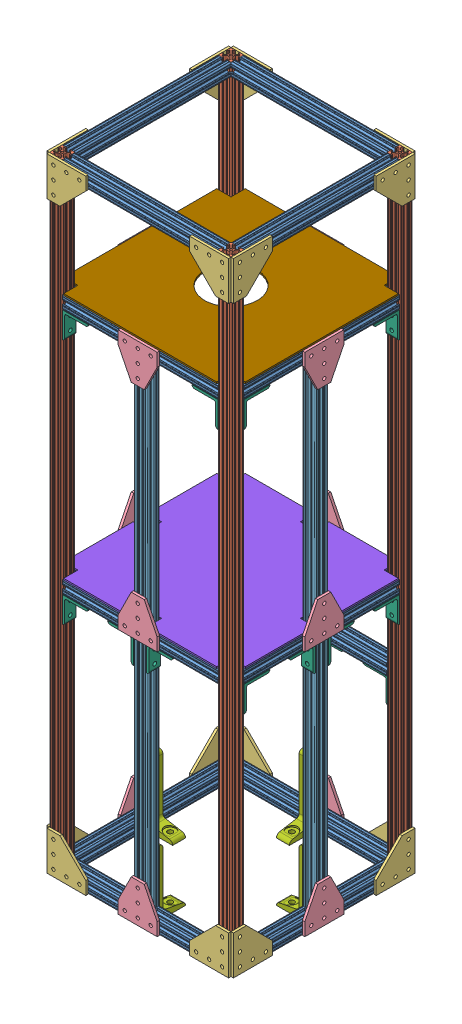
SolidWorks assembly Propellant_Tank_Support.SLDASM, configuration Default (file format 15000). Lengths in mm.
Overall size (367.63 1219.2 365.12).
88 component instances, 9 part files, 259 mates.
Components (placement in the parent):
- 1 foot t slot-1: 1 foot t slot.SLDPRT [47065T411] at (115.7798 156.8335 234.415) size (25.4 25.4 304.8)
- 4 feet t-slot-1: 4 feet t-slot.SLDPRT [47065T413] at (115.7798 906.1335 399.515) x (0 0 1) z (0 -1 0) size (25.4 25.4 1219.2)
- 4 feet t-slot-2: 4 feet t-slot.SLDPRT [47065T413] at (115.7798 601.3335 69.315) x (1 0 0) z (0 1 0) size (25.4 25.4 1219.2)
- 1 foot t slot-2: 1 foot t slot.SLDPRT [47065T411] at (280.8798 156.8335 399.515) x (0 0 1) z (-1 0 0) size (25.4 25.4 304.8)
- 1 foot t slot-3: 1 foot t slot.SLDPRT [47065T411] at (280.8798 321.9335 69.315) x (1 0 0) z (0 -1 0) size (25.4 25.4 304.8)
- 1 foot t slot-4: 1 foot t slot.SLDPRT [47065T411] at (445.9798 156.8335 234.415) size (25.4 25.4 304.8)
- 1 foot t slot-5: 1 foot t slot.SLDPRT [47065T411] at (280.8798 156.8335 69.315) x (0 0 -1) z (1 0 0) size (25.4 25.4 304.8)
- 4 feet t-slot-3: 4 feet t-slot.SLDPRT [47065T413] at (445.9798 906.1335 399.515) x (0 0 1) z (0 -1 0) size (25.4 25.4 1219.2)
- 4 feet t-slot-4: 4 feet t-slot.SLDPRT [47065T413] at (445.9798 601.3335 69.315) x (1 0 0) z (0 1 0) size (25.4 25.4 1219.2)
- 1 foot t slot-6: 1 foot t slot.SLDPRT [47065T411] at (115.7798 1350.6335 234.415) size (25.4 25.4 304.8)
- 1 foot t slot-7: 1 foot t slot.SLDPRT [47065T411] at (280.8798 1350.6335 399.515) x (0 1 0) z (1 0 0) size (25.4 25.4 304.8)
- 1 foot t slot-8: 1 foot t slot.SLDPRT [47065T411] at (280.8798 1350.6335 69.315) x (0 0 1) z (-1 0 0) size (25.4 25.4 304.8)
- corner brace-1: corner brace.SLDPRT [47065T267] at (103.0798 144.1335 54.2337) size (76.2 76.2 4.76)
- corner brace-2: corner brace.SLDPRT [47065T267] at (461.061 144.1335 412.215) x (0 0 -1) z (1 0 0) size (76.2 76.2 4.76)
- corner brace-3: corner brace.SLDPRT [47065T267] at (450.4883 144.1335 54.2337) x (-1 0 0) z (0 0 -1) size (76.2 76.2 4.76)
- corner brace-4: corner brace.SLDPRT [47065T267] at (458.6798 144.1335 414.5962) x (-1 0 0) z (0 0 -1) size (76.2 76.2 4.76)
- corner brace-5: corner brace.SLDPRT [47065T267] at (461.061 144.1335 56.615) x (0 0 1) z (-1 0 0) size (76.2 76.2 4.76)
- corner brace-6: corner brace.SLDPRT [47065T267] at (100.6985 144.1335 56.615) x (0 0 1) z (-1 0 0) size (76.2 76.2 4.76)
- corner brace-7: corner brace.SLDPRT [47065T267] at (100.6985 144.1335 412.215) x (0 0 -1) z (1 0 0) size (76.2 76.2 4.76)
- corner brace-8: corner brace.SLDPRT [47065T267] at (103.0798 144.1335 414.5962) size (76.2 76.2 4.76)
- corner brace-9: corner brace.SLDPRT [47065T267] at (458.6798 1363.3335 414.5962) x (-1 0 0) z (0 0 1) size (76.2 76.2 4.76)
- corner brace-10: corner brace.SLDPRT [47065T267] at (461.061 1363.3335 412.215) x (0 0 -1) z (-1 0 0) size (76.2 76.2 4.76)
- corner brace-11: corner brace.SLDPRT [47065T267] at (100.6985 1363.3335 412.215) x (0 -1 0) z (1 0 0) size (76.2 76.2 4.76)
- corner brace-12: corner brace.SLDPRT [47065T267] at (103.0798 1363.3335 414.5962) x (0 -1 0) z (0 0 1) size (76.2 76.2 4.76)
- corner brace-13: corner brace.SLDPRT [47065T267] at (103.0798 1363.3335 54.2337) x (1 0 0) z (0 0 -1) size (76.2 76.2 4.76)
- corner brace-14: corner brace.SLDPRT [47065T267] at (100.6985 1363.3335 56.615) x (0 0 1) z (1 0 0) size (76.2 76.2 4.76)
- corner brace-15: corner brace.SLDPRT [47065T267] at (461.061 1363.3335 56.615) x (0 -1 0) z (-1 0 0) size (76.2 76.2 4.76)
- corner brace-16: corner brace.SLDPRT [47065T267] at (458.6798 1363.3335 54.2337) x (0 -1 0) z (0 0 -1) size (76.2 76.2 4.76)
- t bracket-1: t bracket.SLDPRT [47065T278] at (100.6985 144.1335 196.315) x (0 0 1) z (-1 0 0) size (76.2 76.2 4.76)
- t bracket-2: t bracket.SLDPRT [47065T278] at (318.9798 1134.7335 54.2337) x (-1 0 0) z (0 0 1) size (76.2 76.2 4.76)
- t bracket-3: t bracket.SLDPRT [47065T278] at (242.7798 144.1335 414.5962) size (76.2 76.2 4.76)
- t bracket-4: t bracket.SLDPRT [47065T278] at (461.061 144.1335 272.515) x (0 0 -1) z (1 0 0) size (76.2 76.2 4.76)
- t bracket-5: t bracket.SLDPRT [47065T278] at (242.7798 144.1335 54.2337) size (76.2 76.2 4.76)
- 1.5 feet t-slot-1: 1.5 feet t-slot.SLDPRT [47065T209] at (445.9798 474.3335 234.415) x (0 0 -1) z (0 -1 0) size (25.4 25.4 457.2)
- 1.5 feet t-slot-2: 1.5 feet t-slot.SLDPRT [47065T209] at (115.7798 474.3335 234.415) x (0 0 1) z (0 -1 0) size (25.4 25.4 457.2)
- 1.5 feet t-slot-3: 1.5 feet t-slot.SLDPRT [47065T209] at (280.8798 321.9335 399.515) x (1 0 0) z (0 1 0) size (25.4 25.4 457.2)
- 1 foot t slot-10: 1 foot t slot.SLDPRT [47065T411] at (115.7798 639.4335 234.415) size (25.4 25.4 304.8)
- 1 foot t slot-11: 1 foot t slot.SLDPRT [47065T411] at (280.8798 639.4335 399.515) x (0 0 1) z (-1 0 0) size (25.4 25.4 304.8)
- 1 foot t slot-12: 1 foot t slot.SLDPRT [47065T411] at (445.9798 639.4335 234.415) size (25.4 25.4 304.8)
- 1 foot t slot-13: 1 foot t slot.SLDPRT [47065T411] at (280.8798 487.0335 69.315) x (0 0 -1) z (1 0 0) size (25.4 25.4 304.8)
- corner brace_2-1: corner brace_2.SLDPRT [47065T239] at (114.1923 626.7335 82.015) x (0 -1 0) z (-1 0 0) size (50.8 50.8 22.23)
- corner brace_2-2: corner brace_2.SLDPRT [47065T239] at (114.1923 626.7335 386.815) x (0 -1 0) z (1 0 0) size (50.8 50.8 22.23)
- corner brace_2-3: corner brace_2.SLDPRT [47065T239] at (447.5673 626.7335 82.015) x (0 -1 0) z (-1 0 0) size (50.8 50.8 22.23)
- corner brace_2-4: corner brace_2.SLDPRT [47065T239] at (433.2798 474.3335 67.7275) x (0 -1 0) z (0 0 -1) size (50.8 50.8 22.23)
- corner brace_2-5: corner brace_2.SLDPRT [47065T239] at (447.5673 626.7335 386.815) x (0 -1 0) z (1 0 0) size (50.8 50.8 22.23)
- corner brace_2-6: corner brace_2.SLDPRT [47065T239] at (128.4798 626.7335 401.1025) x (0 -1 0) z (0 0 1) size (50.8 50.8 22.23)
- corner brace_2-7: corner brace_2.SLDPRT [47065T239] at (128.4798 474.3335 67.7275) x (0 -1 0) z (0 0 1) size (50.8 50.8 22.23)
- 1 foot t slot-14: 1 foot t slot.SLDPRT [47065T411] at (445.9798 1350.6335 234.415) x (-1 0 0) z (0 0 -1) size (25.4 25.4 304.8)
- 1 foot t slot-15: 1 foot t slot.SLDPRT [47065T411] at (280.8798 639.4335 69.315) x (0 0 1) z (-1 0 0) size (25.4 25.4 304.8)
- corner brace_2-8: corner brace_2.SLDPRT [47065T239] at (433.2798 626.7335 67.7275) x (0 -1 0) z (0 0 -1) size (50.8 50.8 22.23)
- corner brace_2-9: corner brace_2.SLDPRT [47065T239] at (128.4798 626.7335 67.7275) x (0 -1 0) z (0 0 1) size (50.8 50.8 22.23)
- 1.5 feet t-slot-4: 1.5 feet t-slot.SLDPRT [47065T209] at (280.8798 804.5335 399.515) x (1 0 0) z (0 1 0) size (25.4 25.4 457.2)
- 1.5 feet t-slot-5: 1.5 feet t-slot.SLDPRT [47065T209] at (115.7798 804.5335 234.415) x (1 0 0) z (0 1 0) size (25.4 25.4 457.2)
- 1.5 feet t-slot-6: 1.5 feet t-slot.SLDPRT [47065T209] at (445.9798 804.5335 234.415) x (1 0 0) z (0 1 0) size (25.4 25.4 457.2)
- 1.5 feet t-slot-7: 1.5 feet t-slot.SLDPRT [47065T209] at (280.8798 804.5335 69.315) x (1 0 0) z (0 1 0) size (25.4 25.4 457.2)
- 1 foot t slot-16: 1 foot t slot.SLDPRT [47065T411] at (445.9798 1122.0335 234.415) size (25.4 25.4 304.8)
- 1 foot t slot-17: 1 foot t slot.SLDPRT [47065T411] at (115.7798 1122.0335 234.415) size (25.4 25.4 304.8)
- 1 foot t slot-18: 1 foot t slot.SLDPRT [47065T411] at (280.8798 1122.0335 69.315) x (0 0 -1) z (1 0 0) size (25.4 25.4 304.8)
- 1 foot t slot-19: 1 foot t slot.SLDPRT [47065T411] at (280.8798 1122.0335 399.515) x (0 0 -1) z (1 0 0) size (25.4 25.4 304.8)
- t bracket-10: t bracket.SLDPRT [47065T278] at (461.061 1134.7335 196.315) x (0 0 1) z (1 0 0) size (76.2 76.2 4.76)
- t bracket-11: t bracket.SLDPRT [47065T278] at (242.7798 1134.7335 414.5962) x (1 0 0) z (0 0 -1) size (76.2 76.2 4.76)
- t bracket-12: t bracket.SLDPRT [47065T278] at (100.6985 1134.7335 272.515) x (0 0 -1) z (-1 0 0) size (76.2 76.2 4.76)
- corner brace_2-11: corner brace_2.SLDPRT [47065T239] at (128.4798 1109.3335 401.1025) x (0 -1 0) z (0 0 1) size (50.8 50.8 22.23)
- corner brace_2-12: corner brace_2.SLDPRT [47065T239] at (433.2798 1109.3335 401.1025) x (0 -1 0) z (0 0 -1) size (50.8 50.8 22.23)
- corner brace_2-13: corner brace_2.SLDPRT [47065T239] at (447.5673 1109.3335 82.015) x (0 -1 0) z (-1 0 0) size (50.8 50.8 22.23)
- corner brace_2-14: corner brace_2.SLDPRT [47065T239] at (447.5673 1109.3335 386.815) x (0 -1 0) z (1 0 0) size (50.8 50.8 22.23)
- corner brace_2-15: corner brace_2.SLDPRT [47065T239] at (128.4798 1109.3335 67.7275) x (0 -1 0) z (0 0 1) size (50.8 50.8 22.23)
- corner brace_2-16: corner brace_2.SLDPRT [47065T239] at (433.2798 1109.3335 67.7275) x (-1 0 0) z (0 0 1) size (50.8 50.8 22.23)
- corner brace_2-17: corner brace_2.SLDPRT [47065T239] at (114.1923 1109.3335 386.815) x (0 -1 0) z (1 0 0) size (50.8 50.8 22.23)
- corner brace_2-18: corner brace_2.SLDPRT [47065T239] at (106.9211 1109.3335 82.015) x (0 -1 0) z (-1 0 0) size (50.8 50.8 22.23)
- 47065T841_ALUMINUM T-SLOTTED FRAMING EXTRUSION-1: 47065T841_ALUMINUM T-SLOTTED FRAMING EXTRUSION.SLDPRT [47065T841] at (433.2798 144.1335 234.415) x (-1 0 0) z (0 0 -1) size (50.8 127 25.4)
- 47065T841_ALUMINUM T-SLOTTED FRAMING EXTRUSION-2: 47065T841_ALUMINUM T-SLOTTED FRAMING EXTRUSION.SLDPRT [47065T841] at (280.8798 144.1335 386.815) x (0 0 -1) z (1 0 0) size (50.8 127 25.4)
- 47065T841_ALUMINUM T-SLOTTED FRAMING EXTRUSION-3: 47065T841_ALUMINUM T-SLOTTED FRAMING EXTRUSION.SLDPRT [47065T841] at (280.8798 144.1335 82.015) x (0 0 1) z (-1 0 0) size (50.8 127 25.4)
- 47065T841_ALUMINUM T-SLOTTED FRAMING EXTRUSION-4: 47065T841_ALUMINUM T-SLOTTED FRAMING EXTRUSION.SLDPRT [47065T841] at (128.4798 144.1335 234.415) size (50.8 127 25.4)
- Tank Support Bottom Plate-1: Tank Support Bottom Plate.SLDPRT [Default] at (280.8798 652.1335 234.415) size (355.6 3.17 355.6)
- Tank Support Top Plate-1: Tank Support Top Plate.SLDPRT [Default] at (280.8798 1134.7335 234.415) size (355.6 3.17 355.6)
- corner brace_2-19: corner brace_2.SLDPRT [47065T239] at (114.1923 626.7335 221.715) x (0 -1 0) z (1 0 0) size (50.8 50.8 22.23)
- corner brace_2-20: corner brace_2.SLDPRT [47065T239] at (447.5673 626.7335 221.715) x (0 -1 0) z (1 0 0) size (50.8 50.8 22.23)
- corner brace_2-21: corner brace_2.SLDPRT [47065T239] at (447.5673 626.7335 247.115) x (0 -1 0) z (-1 0 0) size (50.8 50.8 22.23)
- corner brace_2-22: corner brace_2.SLDPRT [47065T239] at (268.1798 626.7335 401.1025) x (0 -1 0) z (0 0 -1) size (50.8 50.8 22.23)
- corner brace_2-23: corner brace_2.SLDPRT [47065T239] at (293.5798 626.7335 401.1025) x (0 -1 0) z (0 0 1) size (50.8 50.8 22.23)
- corner brace_2-24: corner brace_2.SLDPRT [47065T239] at (114.1923 626.7335 247.115) x (0 -1 0) z (-1 0 0) size (50.8 50.8 22.23)
- corner brace_2-25: corner brace_2.SLDPRT [47065T239] at (293.5798 474.3335 67.7275) x (0 -1 0) z (0 0 1) size (50.8 50.8 22.23)
- corner brace_2-26: corner brace_2.SLDPRT [47065T239] at (268.1798 474.3335 67.7275) x (0 -1 0) z (0 0 -1) size (50.8 50.8 22.23)
- t bracket-13: t bracket.SLDPRT [47065T278] at (461.061 626.7335 196.315) x (0 0 1) z (-1 0 0) size (76.2 76.2 4.76)
- t bracket-14: t bracket.SLDPRT [47065T278] at (318.9798 626.7335 54.2337) x (-1 0 0) z (0 0 -1) size (76.2 76.2 4.76)
- t bracket-15: t bracket.SLDPRT [47065T278] at (242.7798 626.7335 414.5962) size (76.2 76.2 4.76)
- t bracket-16: t bracket.SLDPRT [47065T278] at (100.6985 626.7335 272.515) x (0 0 -1) z (1 0 0) size (76.2 76.2 4.76)
Mates (geometry in assembly coordinates):
- Coincident2: coincident aligned: plane of 1 foot t slot-1 through (122.1129 144.1335 386.815) normal (0 -1 0); plane of 4 feet t-slot-1 through (125.1896 144.1335 393.0986) normal (0 -1 0)
- Coincident3: coincident anti-aligned: plane of 1 foot t slot-1 through (109.3634 147.4237 386.815) normal (0 0 1); plane of 4 feet t-slot-1 through (122.1129 144.1335 386.815) normal (0 0 -1)
- Coincident4: coincident aligned: plane of 1 foot t slot-1 through (103.0798 150.5005 386.815) normal (-1 0 0); plane of 4 feet t-slot-1 through (103.0798 144.1335 393.1819) normal (-1 0 0)
- Coincident5: coincident aligned: plane of 1 foot t slot-1 through (106.2293 144.1335 386.815) normal (0 -1 0); plane of 4 feet t-slot-2 through (103.0798 144.1335 28.8532) normal (0 -1 0)
- Coincident6: coincident anti-aligned: plane of 1 foot t slot-1 through (109.3634 147.4237 82.015) normal (0 0 -1); plane of 4 feet t-slot-2 through (122.1129 1363.3335 82.015) normal (0 0 1)
- Coincident7: coincident aligned: plane of 1 foot t slot-1 through (128.4798 163.1666 386.815) normal (1 0 0); plane of 4 feet t-slot-2 through (128.4798 1363.3335 62.9819) normal (1 0 0)
- Coincident8: coincident aligned: plane of 4 feet t-slot-1 through (125.3302 144.1335 412.215) normal (0 0 1); plane of 1 foot t slot-2 through (128.4798 163.1666 412.215) normal (0 0 1)
- Coincident9: coincident aligned: plane of 4 feet t-slot-1 through (125.1896 144.1335 393.0986) normal (0 -1 0); plane of 1 foot t slot-2 through (128.4798 144.1335 405.8481) normal (0 -1 0)
- Coincident10: coincident anti-aligned: plane of 4 feet t-slot-1 through (128.4798 144.1335 405.8481) normal (1 0 0); plane of 1 foot t slot-2 through (128.4798 147.4237 393.0986) normal (-1 0 0)
- Coincident11: coincident anti-aligned: plane of 1 foot t slot-2 through (433.2798 147.4237 393.0986) normal (1 0 0); plane of 4 feet t-slot-3 through (433.2798 144.1335 409.0654) normal (-1 0 0)
- Coincident12: coincident aligned: plane of 1 foot t slot-2 through (128.4798 163.1666 412.215) normal (0 0 1); plane of 4 feet t-slot-3 through (455.5302 144.1335 412.215) normal (0 0 1)
- Coincident13: coincident aligned: plane of 1 foot t slot-2 through (128.4798 144.1335 389.9645) normal (0 -1 0); plane of 4 feet t-slot-3 through (455.3896 144.1335 393.0986) normal (0 -1 0)
- Coincident14: coincident anti-aligned: plane of 1 foot t slot-4 through (439.5634 147.4237 386.815) normal (0 0 1); plane of 4 feet t-slot-3 through (452.3129 144.1335 386.815) normal (0 0 -1)
- Coincident15: coincident aligned: plane of 1 foot t slot-4 through (458.6798 147.2831 386.815) normal (1 0 0); plane of 4 feet t-slot-3 through (458.6798 144.1335 389.9645) normal (1 0 0)
- Coincident16: coincident aligned: plane of 1 foot t slot-4 through (452.3129 144.1335 386.815) normal (0 -1 0); plane of 4 feet t-slot-3 through (455.3896 144.1335 393.0986) normal (0 -1 0)
- Coincident17: coincident aligned: plane of 4 feet t-slot-2 through (125.3302 1363.3335 56.615) normal (0 0 -1); plane of 1 foot t slot-5 through (433.2798 163.1666 56.615) normal (0 0 -1)
- Coincident18: coincident anti-aligned: plane of 4 feet t-slot-2 through (128.4798 1363.3335 62.9819) normal (1 0 0); plane of 1 foot t slot-5 through (128.4798 147.4237 75.7314) normal (-1 0 0)
- Coincident19: coincident aligned: plane of 4 feet t-slot-2 through (103.0798 144.1335 28.8532) normal (0 -1 0); plane of 1 foot t slot-5 through (433.2798 144.1335 62.9819) normal (0 -1 0)
- Coincident20: coincident aligned: plane of 1 foot t slot-5 through (433.2798 147.2831 56.615) normal (0 0 -1); plane of 4 feet t-slot-4 through (455.5302 1363.3335 56.615) normal (0 0 -1)
- Coincident21: coincident aligned: plane of 1 foot t slot-4 through (458.6798 147.2831 386.815) normal (1 0 0); plane of 4 feet t-slot-4 through (458.6798 1363.3335 62.9819) normal (1 0 0)
- Coincident22: coincident aligned: plane of 1 foot t slot-5 through (433.2798 144.1335 62.9819) normal (0 -1 0); plane of 4 feet t-slot-4 through (433.2798 144.1335 28.8532) normal (0 -1 0)
- Coincident26: coincident aligned: plane of 4 feet t-slot-4 through (439.6467 1363.3335 56.615) normal (0 0 -1); plane of 1 foot t slot-8 through (128.4798 1360.1839 56.615) normal (0 0 -1)
- Coincident27: coincident anti-aligned: plane of 4 feet t-slot-4 through (433.2798 1363.3335 75.6481) normal (-1 0 0); plane of 1 foot t slot-8 through (433.2798 1341.2237 62.8986) normal (1 0 0)
- Coincident28: coincident aligned: plane of 4 feet t-slot-4 through (439.5634 1363.3335 78.7248) normal (0 1 0); plane of 1 foot t slot-8 through (128.4798 1363.3335 78.8654) normal (0 1 0)
- Coincident29: coincident anti-aligned: plane of 4 feet t-slot-2 through (106.2293 1363.3335 82.015) normal (0 0 1); plane of 1 foot t slot-6 through (109.3634 1341.2237 82.015) normal (0 0 -1)
- Coincident30: coincident aligned: plane of 4 feet t-slot-2 through (103.0798 1363.3335 75.6481) normal (-1 0 0); plane of 1 foot t slot-6 through (103.0798 1360.1839 386.815) normal (-1 0 0)
- Coincident31: coincident aligned: plane of 4 feet t-slot-2 through (109.3634 1363.3335 78.7248) normal (0 1 0); plane of 1 foot t slot-6 through (109.4467 1363.3335 386.815) normal (0 1 0)
- Coincident32: coincident aligned: plane of 4 feet t-slot-1 through (125.3302 144.1335 412.215) normal (0 0 1); plane of 1 foot t slot-7 through (433.2798 1360.184 412.215) normal (0 0 1)
- Coincident33: coincident aligned: plane of 4 feet t-slot-1 through (75.318 1363.3335 386.815) normal (0 1 0); plane of 1 foot t slot-7 through (433.2798 1363.3335 405.8481) normal (0 1 0)
- Coincident34: coincident anti-aligned: plane of 4 feet t-slot-1 through (128.4798 144.1335 405.8481) normal (1 0 0); plane of 1 foot t slot-7 through (128.4798 1344.2171 390.1052) normal (-1 0 0)
- Coincident35: coincident aligned: plane of 4 feet t-slot-2 through (103.0798 1363.3335 59.7646) normal (-1 0 0); plane of corner brace-1 through (103.0798 144.1335 56.615) normal (-1 0 0)
- Coincident36: coincident aligned: plane of 4 feet t-slot-2 through (103.0798 144.1335 28.8532) normal (0 -1 0); plane of corner brace-1 through (179.2798 144.1335 56.615) normal (0 -1 0)
- Coincident37: coincident anti-aligned: plane of 4 feet t-slot-2 through (109.4467 1363.3335 56.615) normal (0 0 -1); plane of corner brace-1 through (103.0798 144.1335 56.615) normal (0 0 1)
- Coincident38: coincident anti-aligned: plane of 1 foot t slot-5 through (433.2798 147.2831 56.615) normal (0 0 -1); plane of corner brace-3 through (450.4883 144.1335 56.615) normal (0 0 1)
- Coincident39: coincident aligned: plane of 4 feet t-slot-4 through (450.4883 1363.3335 70.9082) normal (1 0 0); plane of corner brace-3 through (450.4883 144.1335 51.8525) normal (1 0 0)
- Coincident40: coincident aligned: plane of 1 foot t slot-5 through (433.2798 144.1335 62.9819) normal (0 -1 0); plane of corner brace-3 through (374.2883 144.1335 51.8525) normal (0 -1 0)
- Coincident41: coincident anti-aligned: plane of 1 foot t slot-4 through (458.6798 147.2831 386.815) normal (1 0 0); plane of corner brace-5 through (458.6798 144.1335 56.615) normal (-1 0 0)
- Coincident42: coincident aligned: plane of 4 feet t-slot-4 through (455.5302 1363.3335 56.615) normal (0 0 -1); plane of corner brace-5 through (458.6798 144.1335 56.615) normal (0 0 -1)
- Coincident43: coincident aligned: plane of 4 feet t-slot-4 through (433.2798 144.1335 28.8532) normal (0 -1 0); plane of corner brace-5 through (458.6798 144.1335 132.815) normal (0 -1 0)
- Coincident44: coincident aligned: plane of 4 feet t-slot-2 through (109.4467 1363.3335 56.615) normal (0 0 -1); plane of corner brace-6 through (98.3173 144.1335 56.615) normal (0 0 -1)
- Coincident45: coincident aligned: plane of 4 feet t-slot-2 through (103.0798 144.1335 28.8532) normal (0 -1 0); plane of corner brace-6 through (98.3173 144.1335 132.815) normal (0 -1 0)
- Coincident46: coincident anti-aligned: plane of 4 feet t-slot-2 through (103.0798 1363.3335 75.6481) normal (-1 0 0); plane of corner brace-6 through (103.0798 144.1335 56.615) normal (1 0 0)
- Coincident47: coincident aligned: plane of 4 feet t-slot-1 through (109.4467 144.1335 412.215) normal (0 0 1); plane of corner brace-7 through (103.0798 144.1335 412.215) normal (0 0 1)
- Coincident48: coincident aligned: plane of 1 foot t slot-1 through (106.2293 144.1335 386.815) normal (0 -1 0); plane of corner brace-7 through (103.0798 144.1335 336.015) normal (0 -1 0)
- Coincident49: coincident anti-aligned: plane of 1 foot t slot-1 through (103.0798 150.5005 386.815) normal (-1 0 0); plane of corner brace-7 through (103.0798 144.1335 412.215) normal (1 0 0)
- Coincident50: coincident anti-aligned: plane of 4 feet t-slot-3 through (458.6798 144.1335 405.8481) normal (1 0 0); plane of corner brace-2 through (458.6798 144.1335 412.215) normal (-1 0 0)
- Coincident51: coincident aligned: plane of 4 feet t-slot-3 through (455.5302 144.1335 412.215) normal (0 0 1); plane of corner brace-2 through (463.4423 144.1335 412.215) normal (0 0 1)
- Coincident52: coincident aligned: plane of 4 feet t-slot-3 through (455.3896 144.1335 393.0986) normal (0 -1 0); plane of corner brace-2 through (463.4423 144.1335 336.015) normal (0 -1 0)
- Coincident53: coincident anti-aligned: plane of 4 feet t-slot-3 through (439.6467 144.1335 412.215) normal (0 0 1); plane of corner brace-4 through (458.6798 144.1335 412.215) normal (0 0 -1)
- Coincident54: coincident aligned: plane of 4 feet t-slot-3 through (458.6798 144.1335 405.8481) normal (1 0 0); plane of corner brace-4 through (458.6798 144.1335 412.215) normal (1 0 0)
- Coincident55: coincident aligned: plane of 4 feet t-slot-3 through (455.3896 144.1335 393.0986) normal (0 -1 0); plane of corner brace-4 through (382.4798 144.1335 412.215) normal (0 -1 0)
- Coincident56: coincident aligned: plane of 4 feet t-slot-1 through (103.0798 144.1335 409.0654) normal (-1 0 0); plane of corner brace-8 through (103.0798 144.1335 416.9775) normal (-1 0 0)
- Coincident57: coincident aligned: plane of 4 feet t-slot-1 through (125.1896 144.1335 393.0986) normal (0 -1 0); plane of corner brace-8 through (179.2798 144.1335 416.9775) normal (0 -1 0)
- Coincident58: coincident anti-aligned: plane of 4 feet t-slot-1 through (125.3302 144.1335 412.215) normal (0 0 1); plane of corner brace-8 through (103.0798 144.1335 412.215) normal (0 0 -1)
- Coincident59: coincident aligned: plane of 1 foot t slot-7 through (433.2798 1363.3335 405.8481) normal (0 1 0); plane of corner brace-12 through (103.0798 1363.3335 416.9775) normal (0 1 0)
- Coincident60: coincident aligned: plane of 4 feet t-slot-1 through (103.0798 144.1335 409.0654) normal (-1 0 0); plane of corner brace-12 through (103.0798 1287.1335 416.9775) normal (-1 0 0)
- Coincident61: coincident anti-aligned: plane of 4 feet t-slot-1 through (125.3302 144.1335 412.215) normal (0 0 1); plane of corner brace-12 through (103.0798 1363.3335 412.215) normal (0 0 -1)
- Coincident62: coincident anti-aligned: plane of 4 feet t-slot-1 through (103.0798 144.1335 409.0654) normal (-1 0 0); plane of corner brace-11 through (103.0798 1363.3335 412.215) normal (1 0 0)
- Coincident63: coincident aligned: plane of 1 foot t slot-6 through (109.4467 1363.3335 386.815) normal (0 1 0); plane of corner brace-11 through (103.0798 1363.3335 412.215) normal (0 1 0)
- Coincident64: coincident: plane of corner brace-11 through (103.0798 1287.1335 412.215) normal (0 0 1); line of corner brace-12 through (103.0798 1363.3335 412.215) axis (0 -1 0)
- Coincident65: coincident aligned: plane of 1 foot t slot-7 through (433.2798 1363.3335 405.8481) normal (0 1 0); plane of corner brace-9 through (382.4798 1363.3335 416.9775) normal (0 1 0)
- Coincident66: coincident aligned: plane of 4 feet t-slot-3 through (458.6798 144.1335 405.8481) normal (1 0 0); plane of corner brace-9 through (458.6798 1363.3335 416.9775) normal (1 0 0)
- Coincident67: coincident anti-aligned: plane of 4 feet t-slot-3 through (455.5302 144.1335 412.215) normal (0 0 1); plane of corner brace-9 through (458.6798 1363.3335 412.215) normal (0 0 -1)
- Coincident69: coincident: line of corner brace-9 through (458.6798 1287.1335 412.215) axis (0 1 0); plane of corner brace-10 through (458.6798 1363.3335 412.215) normal (0 0 1)
- Coincident70: coincident anti-aligned: plane of 4 feet t-slot-3 through (458.6798 144.1335 405.8481) normal (1 0 0); plane of corner brace-10 through (458.6798 1363.3335 412.215) normal (-1 0 0)
- Coincident72: coincident aligned: plane of 4 feet t-slot-4 through (455.5302 1363.3335 56.615) normal (0 0 -1); plane of corner brace-15 through (458.6798 1287.1335 56.615) normal (0 0 -1)
- Coincident73: coincident aligned: plane of 4 feet t-slot-4 through (439.5634 1363.3335 78.7248) normal (0 1 0); plane of corner brace-15 through (458.6798 1363.3335 56.615) normal (0 1 0)
- Coincident74: coincident: line of corner brace-15 through (458.6798 1363.3335 56.615) axis (0 -1 0); plane of corner brace-16 through (458.6798 1287.1335 51.8525) normal (1 0 0)
- Coincident75: coincident aligned: plane of 4 feet t-slot-4 through (439.5634 1363.3335 78.7248) normal (0 1 0); plane of corner brace-16 through (458.6798 1363.3335 51.8525) normal (0 1 0)
- Coincident76: coincident anti-aligned: plane of 4 feet t-slot-4 through (455.5302 1363.3335 56.615) normal (0 0 -1); plane of corner brace-16 through (458.6798 1363.3335 56.615) normal (0 0 1)
- Coincident77: coincident aligned: plane of 4 feet t-slot-2 through (103.0798 1363.3335 59.7646) normal (-1 0 0); plane of corner brace-13 through (103.0798 1363.3335 51.8525) normal (-1 0 0)
- Coincident78: coincident aligned: plane of 4 feet t-slot-2 through (109.3634 1363.3335 78.7248) normal (0 1 0); plane of corner brace-13 through (179.2798 1363.3335 51.8525) normal (0 1 0)
- Coincident79: coincident anti-aligned: plane of 4 feet t-slot-2 through (109.4467 1363.3335 56.615) normal (0 0 -1); plane of corner brace-13 through (103.0798 1363.3335 56.615) normal (0 0 1)
- Coincident80: coincident: line of corner brace-13 through (103.0798 1287.1335 56.615) axis (0 1 0); plane of corner brace-14 through (103.0798 1363.3335 56.615) normal (0 0 -1)
- Coincident81: coincident aligned: plane of 4 feet t-slot-2 through (109.3634 1363.3335 78.7248) normal (0 1 0); plane of corner brace-14 through (103.0798 1363.3335 132.815) normal (0 1 0)
- Coincident82: coincident anti-aligned: plane of 4 feet t-slot-2 through (103.0798 1363.3335 75.6481) normal (-1 0 0); plane of corner brace-14 through (103.0798 1363.3335 56.615) normal (1 0 0)
- Coincident83: coincident anti-aligned: plane of 1 foot t slot-1 through (103.0798 166.3839 386.815) normal (-1 0 0); plane of t bracket-1 through (103.0798 144.1335 196.315) normal (1 0 0)
- Coincident84: coincident aligned: plane of 1 foot t slot-1 through (106.2293 144.1335 386.815) normal (0 -1 0); plane of t bracket-1 through (98.3173 144.1335 272.515) normal (0 -1 0)
- Distance1: distance = 114.3 mm anti-aligned: plane of t bracket-1 through (98.3173 169.5335 272.515) normal (0 0 1); plane of 4 feet t-slot-1 through (122.1129 144.1335 386.815) normal (0 0 -1)
- Coincident86: coincident anti-aligned: plane of 1 foot t slot-2 through (128.4798 163.1666 412.215) normal (0 0 1); plane of t bracket-3 through (242.7798 144.1335 412.215) normal (0 0 -1)
- Coincident87: coincident aligned: plane of 1 foot t slot-2 through (128.4798 144.1335 405.8481) normal (0 -1 0); plane of t bracket-3 through (318.9798 144.1335 416.9775) normal (0 -1 0)
- Distance2: distance = 114.3 mm anti-aligned: plane of t bracket-3 through (242.7798 144.1335 416.9775) normal (-1 0 0); plane of 4 feet t-slot-1 through (128.4798 144.1335 405.8481) normal (1 0 0)
- Coincident89: coincident anti-aligned: plane of 1 foot t slot-4 through (458.6798 147.2831 386.815) normal (1 0 0); plane of t bracket-4 through (458.6798 144.1335 272.515) normal (-1 0 0)
- Coincident90: coincident aligned: plane of 1 foot t slot-4 through (452.3129 144.1335 386.815) normal (0 -1 0); plane of t bracket-4 through (463.4423 144.1335 196.315) normal (0 -1 0)
- Distance3: distance = 114.3 mm anti-aligned: plane of 4 feet t-slot-3 through (452.3129 144.1335 386.815) normal (0 0 -1); plane of t bracket-4 through (463.4423 144.1335 272.515) normal (0 0 1)
- Coincident92: coincident aligned: plane of 1 foot t slot-5 through (433.2798 144.1335 62.9819) normal (0 -1 0); plane of t bracket-5 through (318.9798 144.1335 56.615) normal (0 -1 0)
- Coincident93: coincident anti-aligned: plane of 1 foot t slot-5 through (433.2798 147.2831 56.615) normal (0 0 -1); plane of t bracket-5 through (242.7798 144.1335 56.615) normal (0 0 1)
- Distance4: distance = 114.3 mm anti-aligned: plane of t bracket-5 through (318.9798 169.5335 56.615) normal (1 0 0); plane of 4 feet t-slot-4 through (433.2798 1363.3335 59.7646) normal (-1 0 0)
- Coincident108: coincident anti-aligned: plane of 1 foot t slot-3 through (274.4634 169.5335 59.9052) normal (0 -1 0); plane of 1 foot t slot-5 through (433.2798 169.5335 59.7645) normal (0 1 0)
- Coincident109: coincident anti-aligned: plane of 1 foot t slot-3 through (271.3293 169.5335 56.615) normal (0 0 -1); plane of t bracket-5 through (242.7798 144.1335 56.615) normal (0 0 1)
- Coincident110: coincident: point of 1 foot t slot-3; moEndPointRef_w of t bracket-5
- Coincident120: coincident anti-aligned: plane of 1 foot t slot-2 through (128.4798 169.5335 409.0654) normal (0 1 0); plane of 1.5 feet t-slot-3 through (268.1798 169.5335 380.9154) normal (0 -1 0)
- Coincident121: coincident anti-aligned: plane of t bracket-3 through (242.7798 144.1335 412.215) normal (0 0 -1); plane of 1.5 feet t-slot-3 through (287.2129 626.7335 412.215) normal (0 0 1)
- Coincident122: coincident: line of t bracket-3 through (293.5798 220.3335 416.9775) axis (0 0 -1); plane of 1.5 feet t-slot-3 through (293.5798 626.7335 409.0654) normal (1 0 0)
- Coincident123: coincident anti-aligned: plane of 1 foot t slot-1 through (125.3302 169.5335 386.815) normal (0 1 0); plane of 1.5 feet t-slot-2 through (125.1896 169.5335 227.9986) normal (0 -1 0)
- Coincident124: coincident anti-aligned: plane of t bracket-1 through (103.0798 144.1335 196.315) normal (1 0 0); plane of 1.5 feet t-slot-2 through (103.0798 169.5335 243.9654) normal (-1 0 0)
- Coincident125: coincident: line of t bracket-1 through (98.3173 220.3335 247.115) axis (1 0 0); plane of 1.5 feet t-slot-2 through (109.4467 169.5335 247.115) normal (0 0 1)
- Coincident126: coincident anti-aligned: plane of 1 foot t slot-4 through (455.5302 169.5335 386.815) normal (0 1 0); plane of 1.5 feet t-slot-1 through (436.57 169.5335 240.8314) normal (0 -1 0)
- Coincident127: coincident anti-aligned: plane of t bracket-4 through (458.6798 144.1335 272.515) normal (-1 0 0); plane of 1.5 feet t-slot-1 through (458.6798 169.5335 224.8645) normal (1 0 0)
- Coincident128: coincident: line of t bracket-4 through (463.4423 220.3335 221.715) axis (-1 0 0); plane of 1.5 feet t-slot-1 through (452.3129 169.5335 221.715) normal (0 0 -1)
- Coincident129: coincident aligned: plane of 1 foot t slot-3 through (287.2129 169.5335 56.615) normal (0 0 -1); plane of 1 foot t slot-13 through (433.2798 493.3666 56.615) normal (0 0 -1)
- Coincident130: coincident anti-aligned: plane of 1 foot t slot-3 through (274.4634 474.3335 59.9052) normal (0 1 0); plane of 1 foot t slot-13 through (433.2798 474.3335 78.8654) normal (0 -1 0)
- Coincident131: coincident anti-aligned: plane of 4 feet t-slot-4 through (433.2798 1363.3335 59.7646) normal (-1 0 0); plane of 1 foot t slot-13 through (433.2798 477.6237 75.7314) normal (1 0 0)
- Coincident132: coincident anti-aligned: plane of 1.5 feet t-slot-1 through (464.5794 626.7335 247.115) normal (0 1 0); plane of 1 foot t slot-12 through (452.3129 626.7335 386.815) normal (0 -1 0)
- Coincident133: coincident aligned: plane of 1.5 feet t-slot-1 through (458.6798 169.5335 224.8645) normal (1 0 0); plane of 1 foot t slot-12 through (458.6798 629.8831 386.815) normal (1 0 0)
- Coincident134: coincident anti-aligned: plane of 4 feet t-slot-3 through (452.3129 144.1335 386.815) normal (0 0 -1); plane of 1 foot t slot-12 through (439.5634 630.0237 386.815) normal (0 0 1)
- Coincident135: coincident aligned: plane of 1.5 feet t-slot-2 through (103.0798 169.5335 228.0819) normal (-1 0 0); plane of 1 foot t slot-10 through (103.0798 633.1005 386.815) normal (-1 0 0)
- Coincident136: coincident: plane of 1.5 feet t-slot-2 through (97.1802 626.7335 221.715) normal (0 1 0); line of 1 foot t slot-10 through (106.2293 626.7335 386.815) axis (0 0 -1)
- Coincident137: coincident anti-aligned: plane of 4 feet t-slot-2 through (106.2293 1363.3335 82.015) normal (0 0 1); plane of 1 foot t slot-10 through (109.3634 630.0237 82.015) normal (0 0 -1)
- Coincident138: coincident aligned: plane of 1.5 feet t-slot-3 through (271.3293 626.7335 412.215) normal (0 0 1); plane of 1 foot t slot-11 through (128.4798 645.7666 412.215) normal (0 0 1)
- Coincident139: coincident anti-aligned: plane of 4 feet t-slot-1 through (128.4798 144.1335 405.8481) normal (1 0 0); plane of 1 foot t slot-11 through (128.4798 630.0237 393.0986) normal (-1 0 0)
- Coincident140: coincident anti-aligned: plane of 1.5 feet t-slot-3 through (274.4634 626.7335 408.9248) normal (0 1 0); plane of 1 foot t slot-11 through (128.4798 626.7335 405.8481) normal (0 -1 0)
- Coincident141: coincident anti-aligned: plane of 4 feet t-slot-2 through (106.2293 1363.3335 82.015) normal (0 0 1); plane of corner brace_2-1 through (103.0798 575.9335 82.015) normal (0 0 -1)
- Coincident142: coincident anti-aligned: plane of 1 foot t slot-10 through (106.2293 626.7335 386.815) normal (0 -1 0); plane of corner brace_2-1 through (103.0798 626.7335 82.015) normal (0 1 0)
- Coincident143: coincident aligned: plane of 1 foot t slot-10 through (103.0798 633.1005 386.815) normal (-1 0 0); plane of corner brace_2-1 through (103.0798 626.7335 128.0398) normal (-1 0 0)
- Coincident144: coincident anti-aligned: plane of 1 foot t slot-10 through (106.2293 626.7335 386.815) normal (0 -1 0); plane of corner brace_2-2 through (125.3048 626.7335 386.815) normal (0 1 0)
- Coincident145: coincident anti-aligned: plane of 4 feet t-slot-1 through (106.2294 144.1335 386.815) normal (0 0 -1); plane of corner brace_2-2 through (125.3048 575.9335 386.815) normal (0 0 1)
- Coincident146: coincident aligned: plane of 1 foot t slot-10 through (103.0798 633.1005 386.815) normal (-1 0 0); plane of corner brace_2-2 through (103.0798 626.7335 340.7902) normal (-1 0 0)
- Coincident147: coincident anti-aligned: plane of 1 foot t slot-12 through (452.3129 626.7335 386.815) normal (0 -1 0); plane of corner brace_2-3 through (436.4548 626.7335 82.015) normal (0 1 0)
- Coincident148: coincident anti-aligned: plane of 4 feet t-slot-4 through (452.3129 1363.3335 82.015) normal (0 0 1); plane of corner brace_2-3 through (436.4548 575.9335 82.015) normal (0 0 -1)
- Coincident149: coincident aligned: plane of 1 foot t slot-12 through (458.6798 629.8831 386.815) normal (1 0 0); plane of corner brace_2-3 through (458.6798 626.7335 128.0398) normal (1 0 0)
- Coincident150: coincident anti-aligned: plane of 1 foot t slot-12 through (452.3129 626.7335 386.815) normal (0 -1 0); plane of corner brace_2-5 through (458.6798 626.7335 386.815) normal (0 1 0)
- Coincident151: coincident anti-aligned: plane of 4 feet t-slot-3 through (452.3129 144.1335 386.815) normal (0 0 -1); plane of corner brace_2-5 through (458.6798 575.9335 386.815) normal (0 0 1)
- Coincident152: coincident aligned: plane of 1 foot t slot-12 through (458.6798 629.8831 386.815) normal (1 0 0); plane of corner brace_2-5 through (458.6798 626.7335 340.7902) normal (1 0 0)
- Coincident153: coincident anti-aligned: plane of 1 foot t slot-11 through (128.4798 626.7335 405.8481) normal (0 -1 0); plane of corner brace_2-6 through (128.4798 626.7335 412.215) normal (0 1 0)
- Coincident154: coincident aligned: plane of 4 feet t-slot-1 through (125.3302 144.1335 412.215) normal (0 0 1); plane of corner brace_2-6 through (174.5046 626.7335 412.215) normal (0 0 1)
- Coincident155: coincident: plane of 4 feet t-slot-1 through (128.4798 144.1335 405.8481) normal (1 0 0); line of corner brace_2-6 through (128.4798 626.7335 412.215) axis (0 -1 0)
- Coincident156: coincident anti-aligned: plane of 1 foot t slot-13 through (433.2798 474.3335 62.9819) normal (0 -1 0); plane of corner brace_2-4 through (433.2798 474.3335 56.615) normal (0 1 0)
- Coincident157: coincident anti-aligned: plane of 4 feet t-slot-4 through (433.2798 1363.3335 59.7646) normal (-1 0 0); plane of corner brace_2-4 through (433.2798 423.5335 56.615) normal (1 0 0)
- Coincident158: coincident aligned: plane of 1 foot t slot-13 through (433.2798 477.4831 56.615) normal (0 0 -1); plane of corner brace_2-4 through (387.255 474.3335 56.615) normal (0 0 -1)
- Coincident159: coincident aligned: plane of 1 foot t slot-13 through (433.2798 477.4831 56.615) normal (0 0 -1); plane of corner brace_2-7 through (174.5046 474.3335 56.615) normal (0 0 -1)
- Coincident160: coincident: line of 1 foot t slot-13 through (433.2798 474.3335 59.7645) axis (-1 0 0); plane of corner brace_2-7 through (128.4798 474.3335 78.84) normal (0 1 0)
- Coincident161: coincident anti-aligned: plane of 4 feet t-slot-2 through (128.4798 1363.3335 62.9819) normal (1 0 0); plane of corner brace_2-7 through (128.4798 423.5335 78.84) normal (-1 0 0)
- Coincident162: coincident aligned: plane of 4 feet t-slot-4 through (439.5634 1363.3335 78.7248) normal (0 1 0); plane of 1 foot t slot-14 through (436.4293 1363.3335 82.015) normal (0 1 0)
- Coincident163: coincident anti-aligned: plane of corner brace-15 through (458.6798 1363.3335 56.615) normal (-1 0 0); plane of 1 foot t slot-14 through (458.6798 1360.1839 82.015) normal (1 0 0)
- Coincident164: coincident anti-aligned: plane of 4 feet t-slot-4 through (436.4293 1363.3335 82.015) normal (0 0 1); plane of 1 foot t slot-14 through (452.3962 1341.2237 82.015) normal (0 0 -1)
- Coincident165: coincident anti-aligned: plane of 4 feet t-slot-4 through (458.6798 1363.3335 78.8654) normal (1 0 0); plane of corner brace-15 through (458.6798 1363.3335 56.615) normal (-1 0 0)
- Coincident166: coincident anti-aligned: plane of 4 feet t-slot-2 through (128.4798 1363.3335 78.8654) normal (1 0 0); plane of 1 foot t slot-15 through (128.4798 630.0237 62.8986) normal (-1 0 0)
- Coincident167: coincident aligned: plane of 1 foot t slot-10 through (125.3302 652.1335 386.815) normal (0 1 0); plane of 1 foot t slot-15 through (128.4798 652.1335 78.8654) normal (0 1 0)
- Coincident169: coincident aligned: plane of 4 feet t-slot-2 through (122.1129 1363.3335 82.015) normal (0 0 1); plane of 1 foot t slot-15 through (128.4798 645.7666 82.015) normal (0 0 1)
- Coincident170: coincident anti-aligned: plane of 1 foot t slot-15 through (128.4798 626.7335 59.7645) normal (0 -1 0); plane of corner brace_2-8 through (433.2798 626.7335 56.615) normal (0 1 0)
- Coincident171: coincident anti-aligned: plane of 4 feet t-slot-4 through (433.2798 1363.3335 59.7646) normal (-1 0 0); plane of corner brace_2-8 through (433.2798 575.9335 56.615) normal (1 0 0)
- Coincident172: coincident aligned: plane of 4 feet t-slot-4 through (439.6467 1363.3335 56.615) normal (0 0 -1); plane of corner brace_2-8 through (387.255 626.7335 56.615) normal (0 0 -1)
- Coincident173: coincident anti-aligned: plane of 1 foot t slot-15 through (128.4798 626.7335 59.7645) normal (0 -1 0); plane of corner brace_2-9 through (128.4798 626.7335 78.84) normal (0 1 0)
- Coincident174: coincident anti-aligned: plane of 4 feet t-slot-2 through (128.4798 1363.3335 62.9819) normal (1 0 0); plane of corner brace_2-9 through (128.4798 575.9335 78.84) normal (-1 0 0)
- Coincident175: coincident aligned: plane of 4 feet t-slot-2 through (109.4467 1363.3335 56.615) normal (0 0 -1); plane of corner brace_2-9 through (174.5046 626.7335 56.615) normal (0 0 -1)
- Coincident179: coincident anti-aligned: plane of 1 foot t slot-11 through (128.4798 652.1335 409.0654) normal (0 1 0); plane of 1.5 feet t-slot-4 through (268.1798 652.1335 380.9154) normal (0 -1 0)
- Coincident180: coincident aligned: plane of 1 foot t slot-11 through (128.4798 645.7666 412.215) normal (0 0 1); plane of 1.5 feet t-slot-4 through (271.3293 1109.3335 412.215) normal (0 0 1)
- Distance10: distance = 139.7 mm anti-aligned: plane of 4 feet t-slot-1 through (128.4798 144.1335 405.8481) normal (1 0 0); plane of 1.5 feet t-slot-4 through (268.1798 1109.3335 405.8481) normal (-1 0 0)
- Coincident183: coincident anti-aligned: plane of 1 foot t slot-10 through (109.4467 652.1335 386.815) normal (0 1 0); plane of 1.5 feet t-slot-5 through (103.0798 652.1335 215.8154) normal (0 -1 0)
- Coincident184: coincident aligned: plane of 1 foot t slot-10 through (103.0798 648.9839 386.815) normal (-1 0 0); plane of 1.5 feet t-slot-5 through (103.0798 1109.3335 240.7481) normal (-1 0 0)
- Coincident185: coincident aligned: plane of 1.5 feet t-slot-2 through (109.4467 169.5335 247.115) normal (0 0 1); plane of 1.5 feet t-slot-5 through (106.2293 1109.3335 247.115) normal (0 0 1)
- Coincident186: coincident anti-aligned: plane of 1 foot t slot-12 through (455.5302 652.1335 386.815) normal (0 1 0); plane of 1.5 feet t-slot-6 through (433.2798 652.1335 215.8154) normal (0 -1 0)
- Coincident187: coincident aligned: plane of 1 foot t slot-12 through (458.6798 645.7666 386.815) normal (1 0 0); plane of 1.5 feet t-slot-6 through (458.6798 1109.3335 228.0819) normal (1 0 0)
- Coincident188: coincident aligned: plane of 1.5 feet t-slot-1 through (452.3129 169.5335 221.715) normal (0 0 -1); plane of 1.5 feet t-slot-6 through (455.5302 1109.3335 221.715) normal (0 0 -1)
- Coincident189: coincident anti-aligned: plane of 1 foot t slot-15 through (128.4798 652.1335 62.9819) normal (0 1 0); plane of 1.5 feet t-slot-7 through (268.1798 652.1335 50.7154) normal (0 -1 0)
- Coincident190: coincident aligned: plane of 1 foot t slot-15 through (128.4798 648.9839 56.615) normal (0 0 -1); plane of 1.5 feet t-slot-7 through (290.4302 1109.3335 56.615) normal (0 0 -1)
- Coincident191: coincident aligned: plane of 1 foot t slot-3 through (293.5798 169.5335 59.7646) normal (1 0 0); plane of 1.5 feet t-slot-7 through (293.5798 1109.3335 62.9819) normal (1 0 0)
- Coincident192: coincident aligned: plane of 1.5 feet t-slot-6 through (458.6798 1109.3335 228.0819) normal (1 0 0); plane of 1 foot t slot-16 through (458.6798 1128.3666 386.815) normal (1 0 0)
- Coincident193: coincident anti-aligned: plane of 1.5 feet t-slot-6 through (439.5634 1109.3335 243.8248) normal (0 1 0); plane of 1 foot t slot-16 through (452.3129 1109.3335 386.815) normal (0 -1 0)
- Coincident194: coincident anti-aligned: plane of 4 feet t-slot-3 through (452.3129 144.1335 386.815) normal (0 0 -1); plane of 1 foot t slot-16 through (439.5634 1112.6237 386.815) normal (0 0 1)
- Coincident195: coincident anti-aligned: plane of 1.5 feet t-slot-7 through (274.4634 1109.3335 78.7248) normal (0 1 0); plane of 1 foot t slot-18 through (433.2798 1109.3335 62.9819) normal (0 -1 0)
- Coincident196: coincident aligned: plane of 1.5 feet t-slot-7 through (274.5467 1109.3335 56.615) normal (0 0 -1); plane of 1 foot t slot-18 through (433.2798 1128.3666 56.615) normal (0 0 -1)
- Coincident197: coincident anti-aligned: plane of 4 feet t-slot-4 through (433.2798 1363.3335 75.6481) normal (-1 0 0); plane of 1 foot t slot-18 through (433.2798 1112.6237 75.7314) normal (1 0 0)
- Coincident198: coincident anti-aligned: plane of 1.5 feet t-slot-5 through (109.3634 1109.3335 243.8248) normal (0 1 0); plane of 1 foot t slot-17 through (106.2293 1109.3335 386.815) normal (0 -1 0)
- Coincident199: coincident aligned: plane of 1.5 feet t-slot-5 through (103.0798 1109.3335 240.7481) normal (-1 0 0); plane of 1 foot t slot-17 through (103.0798 1131.5839 386.815) normal (-1 0 0)
- Coincident200: coincident anti-aligned: plane of 4 feet t-slot-1 through (106.2294 144.1335 386.815) normal (0 0 -1); plane of 1 foot t slot-17 through (109.3634 1112.6237 386.815) normal (0 0 1)
- Coincident201: coincident aligned: plane of 1.5 feet t-slot-4 through (287.2129 1109.3335 412.215) normal (0 0 1); plane of 1 foot t slot-19 through (433.2798 1131.5839 412.215) normal (0 0 1)
- Coincident202: coincident anti-aligned: plane of 1.5 feet t-slot-4 through (274.4634 1109.3335 408.9248) normal (0 1 0); plane of 1 foot t slot-19 through (433.2798 1109.3335 409.0654) normal (0 -1 0)
- Coincident203: coincident anti-aligned: plane of 4 feet t-slot-3 through (433.2798 144.1335 409.0654) normal (-1 0 0); plane of 1 foot t slot-19 through (433.2798 1112.6237 405.9314) normal (1 0 0)
- Coincident204: coincident anti-aligned: plane of t bracket-2 through (318.9798 1134.7335 56.615) normal (0 0 1); plane of 1 foot t slot-18 through (433.2798 1112.4831 56.615) normal (0 0 -1)
- Coincident205: coincident aligned: plane of t bracket-2 through (242.7798 1134.7335 56.615) normal (0 1 0); plane of 1 foot t slot-18 through (433.2798 1134.7335 59.7645) normal (0 1 0)
- Coincident206: coincident: line of t bracket-2 through (268.1798 1058.5335 56.615) axis (0 0 -1); plane of 1.5 feet t-slot-7 through (268.1798 1109.3335 59.7646) normal (-1 0 0)
- Coincident207: coincident aligned: plane of 1 foot t slot-17 through (109.4467 1134.7335 386.815) normal (0 1 0); plane of t bracket-12 through (98.3173 1134.7335 196.315) normal (0 1 0)
- Coincident208: coincident anti-aligned: plane of 1 foot t slot-17 through (103.0798 1131.5839 386.815) normal (-1 0 0); plane of t bracket-12 through (103.0798 1134.7335 272.515) normal (1 0 0)
- Coincident209: coincident: plane of 1.5 feet t-slot-5 through (109.4467 1109.3335 221.715) normal (0 0 -1); line of t bracket-12 through (98.3173 1058.5335 221.715) axis (1 0 0)
- Coincident211: coincident: line of 1 foot t slot-19 through (433.2798 1134.7335 409.0654) axis (-1 0 0); plane of t bracket-11 through (318.9798 1134.7335 412.215) normal (0 1 0)
- Coincident212: coincident anti-aligned: plane of 1 foot t slot-19 through (433.2798 1131.5839 412.215) normal (0 0 1); plane of t bracket-11 through (242.7798 1134.7335 412.215) normal (0 0 -1)
- Coincident214: coincident: plane of 1.5 feet t-slot-4 through (268.1798 1109.3335 405.8481) normal (-1 0 0); line of t bracket-11 through (268.1798 1058.5335 412.215) axis (0 0 1)
- Coincident215: coincident anti-aligned: plane of 1 foot t slot-16 through (458.6798 1128.3666 386.815) normal (1 0 0); plane of t bracket-10 through (458.6798 1134.7335 196.315) normal (-1 0 0)
- Coincident216: coincident aligned: plane of 1 foot t slot-16 through (455.5302 1134.7335 386.815) normal (0 1 0); plane of t bracket-10 through (463.4423 1134.7335 272.515) normal (0 1 0)
- Coincident217: coincident: plane of 1.5 feet t-slot-6 through (455.5302 1109.3335 221.715) normal (0 0 -1); line of t bracket-10 through (463.4423 1058.5335 221.715) axis (-1 0 0)
- Coincident218: coincident anti-aligned: plane of 1 foot t slot-16 through (452.3129 1109.3335 386.815) normal (0 -1 0); plane of corner brace_2-13 through (436.4548 1109.3335 82.015) normal (0 1 0)
- Coincident219: coincident anti-aligned: plane of 4 feet t-slot-4 through (452.3129 1363.3335 82.015) normal (0 0 1); plane of corner brace_2-13 through (436.4548 1058.5335 82.015) normal (0 0 -1)
- Coincident220: coincident aligned: plane of 1 foot t slot-16 through (458.6798 1112.4831 386.815) normal (1 0 0); plane of corner brace_2-13 through (458.6798 1109.3335 128.0398) normal (1 0 0)
- Coincident221: coincident anti-aligned: plane of 1 foot t slot-16 through (452.3129 1109.3335 386.815) normal (0 -1 0); plane of corner brace_2-14 through (458.6798 1109.3335 386.815) normal (0 1 0)
- Coincident222: coincident anti-aligned: plane of 4 feet t-slot-3 through (452.3129 144.1335 386.815) normal (0 0 -1); plane of corner brace_2-14 through (458.6798 1058.5335 386.815) normal (0 0 1)
- Coincident223: coincident aligned: plane of 1 foot t slot-16 through (458.6798 1112.4831 386.815) normal (1 0 0); plane of corner brace_2-14 through (458.6798 1109.3335 340.7902) normal (1 0 0)
- Coincident224: coincident anti-aligned: plane of 1 foot t slot-19 through (433.2798 1109.3335 409.0654) normal (0 -1 0); plane of corner brace_2-11 through (128.4798 1109.3335 412.215) normal (0 1 0)
- Coincident225: coincident anti-aligned: plane of 4 feet t-slot-1 through (128.4798 144.1335 405.8481) normal (1 0 0); plane of corner brace_2-11 through (128.4798 1058.5335 412.215) normal (-1 0 0)
- Coincident226: coincident aligned: plane of 4 feet t-slot-1 through (125.3302 144.1335 412.215) normal (0 0 1); plane of corner brace_2-11 through (174.5046 1109.3335 412.215) normal (0 0 1)
- Coincident227: coincident anti-aligned: plane of 1 foot t slot-19 through (433.2798 1109.3335 409.0654) normal (0 -1 0); plane of corner brace_2-12 through (433.2798 1109.3335 389.99) normal (0 1 0)
- Coincident228: coincident anti-aligned: plane of 4 feet t-slot-3 through (433.2798 144.1335 409.0654) normal (-1 0 0); plane of corner brace_2-12 through (433.2798 1058.5335 389.99) normal (1 0 0)
- Coincident229: coincident aligned: plane of 4 feet t-slot-3 through (439.6467 144.1335 412.215) normal (0 0 1); plane of corner brace_2-12 through (387.255 1109.3335 412.215) normal (0 0 1)
- Coincident230: coincident anti-aligned: plane of 1 foot t slot-17 through (106.2293 1109.3335 386.815) normal (0 -1 0); plane of corner brace_2-17 through (125.3048 1109.3335 386.815) normal (0 1 0)
- Coincident231: coincident anti-aligned: plane of 4 feet t-slot-1 through (106.2294 144.1335 386.815) normal (0 0 -1); plane of corner brace_2-17 through (125.3048 1058.5335 386.815) normal (0 0 1)
- Coincident232: coincident aligned: plane of 4 feet t-slot-1 through (103.0798 144.1335 393.1819) normal (-1 0 0); plane of corner brace_2-17 through (103.0798 1109.3335 340.7902) normal (-1 0 0)
- Coincident233: coincident anti-aligned: plane of 1 foot t slot-17 through (106.2293 1109.3335 386.815) normal (0 -1 0); plane of corner brace_2-18 through (95.8086 1109.3335 82.015) normal (0 1 0)
- Coincident234: coincident anti-aligned: plane of 4 feet t-slot-2 through (106.2293 1363.3335 82.015) normal (0 0 1); plane of corner brace_2-18 through (95.8086 1058.5335 82.015) normal (0 0 -1)
- Coincident235: coincident anti-aligned: plane of 4 feet t-slot-2 through (128.4798 1363.3335 62.9819) normal (1 0 0); plane of corner brace_2-15 through (128.4798 1058.5335 78.84) normal (-1 0 0)
- Coincident236: coincident anti-aligned: plane of 1 foot t slot-18 through (433.2798 1109.3335 62.9819) normal (0 -1 0); plane of corner brace_2-15 through (128.4798 1109.3335 78.84) normal (0 1 0)
- Coincident237: coincident aligned: plane of 4 feet t-slot-2 through (125.3302 1363.3335 56.615) normal (0 0 -1); plane of corner brace_2-15 through (174.5046 1109.3335 56.615) normal (0 0 -1)
- Coincident239: coincident anti-aligned: plane of 1 foot t slot-18 through (433.2798 1109.3335 62.9819) normal (0 -1 0); plane of corner brace_2-16 through (382.4798 1109.3335 78.84) normal (0 1 0)
- Coincident240: coincident anti-aligned: plane of 4 feet t-slot-4 through (433.2798 1363.3335 59.7646) normal (-1 0 0); plane of corner brace_2-16 through (433.2798 1109.3335 78.84) normal (1 0 0)
- Coincident241: coincident: line of 1 foot t slot-18 through (433.2798 1115.7005 56.615) axis (-1 0 0); plane of corner brace_2-16 through (433.2798 1063.3087 56.615) normal (0 0 -1)
- Coincident247: coincident anti-aligned: plane of 1.5 feet t-slot-1 through (433.2798 169.5335 228.0819) normal (-1 0 0); plane of 47065T841_ALUMINUM T-SLOTTED FRAMING EXTRUSION-1 through (433.2798 144.1335 221.715) normal (1 0 0)
- Coincident248: coincident aligned: plane of t bracket-4 through (463.4423 144.1335 196.315) normal (0 -1 0); plane of 47065T841_ALUMINUM T-SLOTTED FRAMING EXTRUSION-1 through (382.4798 144.1335 221.715) normal (0 -1 0)
- Coincident249: coincident aligned: plane of 1.5 feet t-slot-1 through (436.4294 169.5335 221.715) normal (0 0 -1); plane of 47065T841_ALUMINUM T-SLOTTED FRAMING EXTRUSION-1 through (433.2798 264.7835 221.715) normal (0 0 -1)
- Coincident250: coincident aligned: plane of 1 foot t slot-3 through (268.1798 169.5335 78.8654) normal (-1 0 0); plane of 47065T841_ALUMINUM T-SLOTTED FRAMING EXTRUSION-3 through (268.1798 264.7835 82.015) normal (-1 0 0)
- Coincident251: coincident anti-aligned: plane of 1 foot t slot-3 through (274.5467 169.5335 82.015) normal (0 0 1); plane of 47065T841_ALUMINUM T-SLOTTED FRAMING EXTRUSION-3 through (268.1798 144.1335 82.015) normal (0 0 -1)
- Coincident252: coincident aligned: plane of t bracket-5 through (318.9798 144.1335 56.615) normal (0 -1 0); plane of 47065T841_ALUMINUM T-SLOTTED FRAMING EXTRUSION-3 through (268.1798 144.1335 132.815) normal (0 -1 0)
- Coincident253: coincident aligned: plane of 1.5 feet t-slot-2 through (125.3302 169.5335 247.115) normal (0 0 1); plane of 47065T841_ALUMINUM T-SLOTTED FRAMING EXTRUSION-4 through (128.4798 264.7835 247.115) normal (0 0 1)
- Coincident254: coincident anti-aligned: plane of 1.5 feet t-slot-2 through (128.4798 169.5335 240.7481) normal (1 0 0); plane of 47065T841_ALUMINUM T-SLOTTED FRAMING EXTRUSION-4 through (128.4798 144.1335 247.115) normal (-1 0 0)
- Coincident255: coincident aligned: plane of 1 foot t slot-1 through (122.1129 144.1335 386.815) normal (0 -1 0); plane of 47065T841_ALUMINUM T-SLOTTED FRAMING EXTRUSION-4 through (179.2798 144.1335 247.115) normal (0 -1 0)
- Coincident256: coincident anti-aligned: plane of 1.5 feet t-slot-3 through (290.4302 626.7335 386.815) normal (0 0 -1); plane of 47065T841_ALUMINUM T-SLOTTED FRAMING EXTRUSION-2 through (293.5798 144.1335 386.815) normal (0 0 1)
- Coincident257: coincident aligned: plane of 1 foot t slot-2 through (128.4798 144.1335 389.9645) normal (0 -1 0); plane of 47065T841_ALUMINUM T-SLOTTED FRAMING EXTRUSION-2 through (293.5798 144.1335 336.015) normal (0 -1 0)
- Coincident258: coincident aligned: plane of 1.5 feet t-slot-3 through (293.5798 626.7335 393.1819) normal (1 0 0); plane of 47065T841_ALUMINUM T-SLOTTED FRAMING EXTRUSION-2 through (293.5798 264.7835 386.815) normal (1 0 0)
- Coincident259: coincident aligned: plane of 1 foot t slot-11 through (128.4798 645.7666 412.215) normal (0 0 1); plane of Tank Support Bottom Plate-1 through (280.8798 655.3085 412.215) normal (0 0 1)
- Coincident260: coincident aligned: plane of 1 foot t slot-12 through (458.6798 645.7666 386.815) normal (1 0 0); plane of Tank Support Bottom Plate-1 through (458.6798 655.3085 234.415) normal (1 0 0)
- Coincident261: coincident anti-aligned: plane of 1 foot t slot-11 through (128.4798 652.1335 393.1819) normal (0 1 0); plane of Tank Support Bottom Plate-1 through (280.8798 652.1335 234.415) normal (0 -1 0)
- Coincident263: coincident: plane of 1 foot t slot-19 through (433.2798 1131.5839 412.215) normal (0 0 1); plane of Tank Support Top Plate-1 through (280.8798 1137.9085 412.215) normal (0 0 1)
- Coincident264: coincident: plane of 1 foot t slot-16 through (458.6798 1128.3666 386.815) normal (1 0 0); plane of Tank Support Top Plate-1 through (458.6798 1137.9085 234.415) normal (1 0 0)
- Coincident265: coincident anti-aligned: plane of 1 foot t slot-16 through (455.5302 1134.7335 386.815) normal (0 1 0); plane of Tank Support Top Plate-1 through (280.8798 1134.7335 234.415) normal (0 -1 0)
- Coincident266: coincident: plane of 1 foot t slot-12 through (452.3129 626.7335 386.815) normal (0 -1 0); plane of corner brace_2-20 through (458.6798 626.7335 221.715) normal (0 1 0)
- Coincident267: coincident: plane of 1.5 feet t-slot-1 through (452.3129 169.5335 221.715) normal (0 0 -1); plane of corner brace_2-20 through (458.6798 575.9335 221.715) normal (0 0 1)
- Coincident268: coincident aligned: plane of 1 foot t slot-12 through (458.6798 629.8831 386.815) normal (1 0 0); plane of corner brace_2-20 through (458.6798 626.7335 175.6902) normal (1 0 0)
- Coincident269: coincident: plane of 1 foot t slot-12 through (452.3129 626.7335 386.815) normal (0 -1 0); plane of corner brace_2-21 through (436.4548 626.7335 247.115) normal (0 1 0)
- Coincident270: coincident: plane of 1.5 feet t-slot-1 through (455.5302 169.5335 247.115) normal (0 0 1); plane of corner brace_2-21 through (436.4548 575.9335 247.115) normal (0 0 -1)
- Coincident271: coincident aligned: plane of 1 foot t slot-12 through (458.6798 629.8831 386.815) normal (1 0 0); plane of corner brace_2-21 through (458.6798 626.7335 293.1398) normal (1 0 0)
- Coincident272: coincident: plane of 1 foot t slot-11 through (128.4798 626.7335 405.8481) normal (0 -1 0); plane of corner brace_2-23 through (293.5798 626.7335 412.215) normal (0 1 0)
- Coincident273: coincident: plane of 1.5 feet t-slot-3 through (293.5798 626.7335 409.0654) normal (1 0 0); plane of corner brace_2-23 through (293.5798 575.9335 412.215) normal (-1 0 0)
- Coincident274: coincident aligned: plane of 1 foot t slot-11 through (128.4798 629.8831 412.215) normal (0 0 1); plane of corner brace_2-23 through (339.6046 626.7335 412.215) normal (0 0 1)
- Coincident275: coincident: plane of 1 foot t slot-11 through (128.4798 626.7335 405.8481) normal (0 -1 0); plane of corner brace_2-22 through (268.1798 626.7335 389.99) normal (0 1 0)
- Coincident276: coincident: plane of 1.5 feet t-slot-3 through (268.1798 626.7335 405.8481) normal (-1 0 0); plane of corner brace_2-22 through (268.1798 575.9335 389.99) normal (1 0 0)
- Coincident277: coincident aligned: plane of 1 foot t slot-11 through (128.4798 629.8831 412.215) normal (0 0 1); plane of corner brace_2-22 through (222.155 626.7335 412.215) normal (0 0 1)
- Coincident278: coincident: plane of 1 foot t slot-10 through (106.2293 626.7335 386.815) normal (0 -1 0); plane of corner brace_2-19 through (125.3048 626.7335 221.715) normal (0 1 0)
- Coincident279: coincident: plane of 1.5 feet t-slot-2 through (106.2294 169.5335 221.715) normal (0 0 -1); plane of corner brace_2-19 through (125.3048 575.9335 221.715) normal (0 0 1)
- Coincident280: coincident aligned: plane of 1 foot t slot-10 through (103.0798 633.1005 386.815) normal (-1 0 0); plane of corner brace_2-19 through (103.0798 626.7335 175.6902) normal (-1 0 0)
- Coincident281: coincident: plane of 1 foot t slot-10 through (106.2293 626.7335 386.815) normal (0 -1 0); plane of corner brace_2-24 through (103.0798 626.7335 247.115) normal (0 1 0)
- Coincident282: coincident: plane of 1.5 feet t-slot-2 through (109.4467 169.5335 247.115) normal (0 0 1); plane of corner brace_2-24 through (103.0798 575.9335 247.115) normal (0 0 -1)
- Coincident283: coincident aligned: plane of 1 foot t slot-10 through (103.0798 633.1005 386.815) normal (-1 0 0); plane of corner brace_2-24 through (103.0798 626.7335 293.1398) normal (-1 0 0)
- Coincident284: coincident: plane of 1 foot t slot-13 through (433.2798 474.3335 62.9819) normal (0 -1 0); plane of corner brace_2-26 through (268.1798 474.3335 56.615) normal (0 1 0)
- Coincident285: coincident: plane of 1 foot t slot-3 through (268.1798 169.5335 62.9819) normal (-1 0 0); plane of corner brace_2-26 through (268.1798 423.5335 56.615) normal (1 0 0)
- Coincident286: coincident aligned: plane of 1 foot t slot-13 through (433.2798 477.4831 56.615) normal (0 0 -1); plane of corner brace_2-26 through (222.155 474.3335 56.615) normal (0 0 -1)
- Coincident287: coincident: plane of 1 foot t slot-13 through (433.2798 474.3335 62.9819) normal (0 -1 0); plane of corner brace_2-25 through (293.5798 474.3335 78.84) normal (0 1 0)
- Coincident288: coincident: line of 1 foot t slot-3 through (293.5798 169.5335 62.9819) axis (0 1 0); plane of corner brace_2-25 through (293.5798 423.5335 78.84) normal (-1 0 0)
- Coincident289: coincident aligned: plane of 1 foot t slot-13 through (433.2798 477.4831 56.615) normal (0 0 -1); plane of corner brace_2-25 through (339.6046 474.3335 56.615) normal (0 0 -1)
- Coincident290: coincident: plane of 1 foot t slot-10 through (106.2293 626.7335 386.815) normal (0 -1 0); plane of t bracket-16 through (103.0798 626.7335 196.315) normal (0 -1 0)
- Coincident291: coincident: plane of 1 foot t slot-10 through (103.0798 648.9839 386.815) normal (-1 0 0); plane of t bracket-16 through (103.0798 626.7335 272.515) normal (1 0 0)
- Coincident292: coincident: plane of 1.5 feet t-slot-5 through (106.2293 1109.3335 247.115) normal (0 0 1); line of t bracket-16 through (103.0798 702.9335 247.115) axis (-1 0 0)
- Coincident293: coincident: plane of 1.5 feet t-slot-4 through (287.2129 1109.3335 412.215) normal (0 0 1); plane of t bracket-15 through (242.7798 626.7335 412.215) normal (0 0 -1)
- Tangent1: tangent: cylinder of 1 foot t slot-11 through (128.4798 628.8417 410.1068) axis (1 0 0) radius 2.1082; plane of t bracket-15 through (318.9798 626.7335 416.9775) normal (0 -1 0)
- Coincident294: coincident: plane of 1.5 feet t-slot-4 through (293.5798 1109.3335 409.0654) normal (1 0 0); line of t bracket-15 through (293.5798 702.9335 416.9775) axis (0 0 -1)
- Coincident295: coincident: plane of 1 foot t slot-15 through (128.4798 648.9839 56.615) normal (0 0 -1); plane of t bracket-14 through (318.9798 626.7335 56.615) normal (0 0 1)
- Coincident296: coincident: plane of 1 foot t slot-15 through (128.4798 626.7335 59.7645) normal (0 -1 0); plane of t bracket-14 through (242.7798 626.7335 51.8525) normal (0 -1 0)
- Coincident297: coincident: plane of 1.5 feet t-slot-7 through (293.5798 1109.3335 62.9819) normal (1 0 0); line of t bracket-14 through (293.5798 702.9335 51.8525) axis (0 0 1)
- Coincident298: coincident: plane of 1 foot t slot-12 through (458.6798 645.7666 386.815) normal (1 0 0); plane of t bracket-13 through (458.6798 626.7335 196.315) normal (-1 0 0)
- Coincident299: coincident: plane of 1 foot t slot-12 through (452.3129 626.7335 386.815) normal (0 -1 0); plane of t bracket-13 through (458.6798 626.7335 272.515) normal (0 -1 0)
- Coincident300: coincident: plane of 1.5 feet t-slot-6 through (455.5302 1109.3335 221.715) normal (0 0 -1); line of t bracket-13 through (458.6798 702.9335 221.715) axis (1 0 0)
